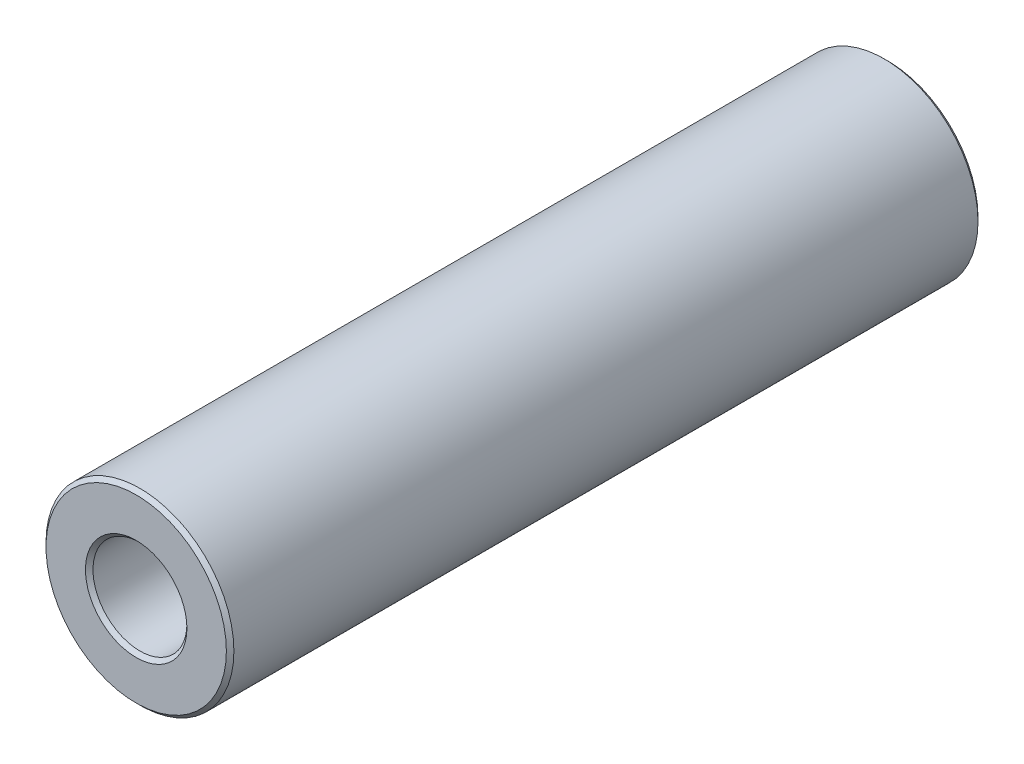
from build123d import *

# Parameters (mm, degrees)
SKETCH1_R           = 2.5
SKETCH1_R_2         = 1.25
BOSS_EXTRUDE2_DEPTH = 10
CHAMFER3_SIZE       = 0.1


with BuildPart() as part:
    # Sketch1 → Boss-Extrude2 (new, symmetric)
    with BuildSketch(Plane.XY):
        Circle(SKETCH1_R)
        Circle(SKETCH1_R_2, mode=Mode.SUBTRACT)
    extrude(amount=BOSS_EXTRUDE2_DEPTH, both=True)

    # Chamfer3
    chamfer3_edges = [part.edges().sort_by_distance(p)[0] for p in [
        (-2.5, 0, -10),
        (-2.5, 0, 10),
        (-1.25, 0, -10),
        (-1.25, 0, 10),
    ]]
    chamfer(chamfer3_edges, length=CHAMFER3_SIZE)


solid = part.part
